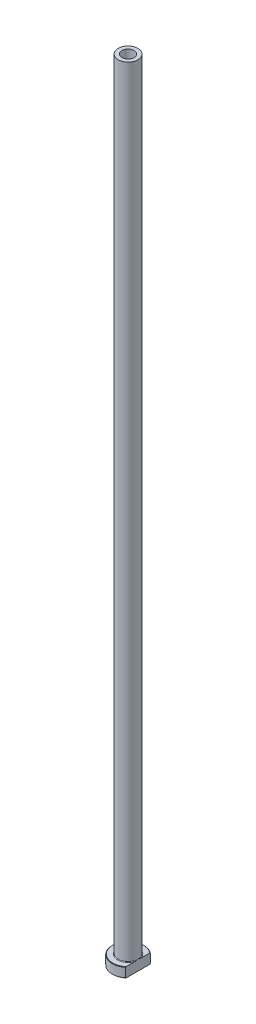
ISO-10303-21;
HEADER;
FILE_DESCRIPTION(('STEP AP214'),'2;1');
FILE_NAME('part.step','',(''),(''),'','','');
FILE_SCHEMA(('AUTOMOTIVE_DESIGN { 1 0 10303 214 1 1 1 1 }'));
ENDSEC;
DATA;
#1=APPLICATION_CONTEXT('core data for automotive mechanical design processes');
#2=APPLICATION_PROTOCOL_DEFINITION('international standard','automotive_design',2000,#1);
#3=PRODUCT_CONTEXT('',#1,'mechanical');
#4=PRODUCT('Part','Part','',(#3));
#5=PRODUCT_RELATED_PRODUCT_CATEGORY('part','',(#4));
#6=PRODUCT_DEFINITION_FORMATION('','',#4);
#7=PRODUCT_DEFINITION_CONTEXT('part definition',#1,'design');
#8=PRODUCT_DEFINITION('design','',#6,#7);
#9=PRODUCT_DEFINITION_SHAPE('','',#8);
#10=(LENGTH_UNIT() NAMED_UNIT(*) SI_UNIT(.MILLI.,.METRE.));
#11=(NAMED_UNIT(*) PLANE_ANGLE_UNIT() SI_UNIT($,.RADIAN.));
#12=(NAMED_UNIT(*) SI_UNIT($,.STERADIAN.) SOLID_ANGLE_UNIT());
#13=UNCERTAINTY_MEASURE_WITH_UNIT(LENGTH_MEASURE(1.E-05),#10,'distance_accuracy_value','');
#14=(GEOMETRIC_REPRESENTATION_CONTEXT(3) GLOBAL_UNCERTAINTY_ASSIGNED_CONTEXT((#13)) GLOBAL_UNIT_ASSIGNED_CONTEXT((#10,
#11,#12)) REPRESENTATION_CONTEXT('',''));
#15=CARTESIAN_POINT('',(0.,0.,0.));
#16=DIRECTION('',(0.,0.,1.));
#17=DIRECTION('',(1.,0.,0.));
#18=AXIS2_PLACEMENT_3D('',#15,#16,#17);
#19=CARTESIAN_POINT('',(0.,92.1876809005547,0.));
#20=DIRECTION('',(0.,1.,0.));
#21=DIRECTION('',(0.,0.,1.));
#22=AXIS2_PLACEMENT_3D('',#19,#20,#21);
#23=CYLINDRICAL_SURFACE('',#22,3.10000000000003);
#24=CARTESIAN_POINT('',(0.,400.,0.));
#25=DIRECTION('',(0.,1.,0.));
#26=DIRECTION('',(0.,0.,1.));
#27=AXIS2_PLACEMENT_3D('',#24,#25,#26);
#28=CIRCLE('',#27,3.10000000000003);
#29=CARTESIAN_POINT('',(0.,400.,3.10000000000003));
#30=VERTEX_POINT('',#29);
#31=EDGE_CURVE('E167',#30,#30,#28,.T.);
#32=ORIENTED_EDGE('',*,*,#31,.T.);
#33=EDGE_LOOP('',(#32));
#34=FACE_BOUND('',#33,.T.);
#35=CARTESIAN_POINT('',(0.,355.,0.));
#36=DIRECTION('',(0.,1.,0.));
#37=DIRECTION('',(0.,0.,1.));
#38=AXIS2_PLACEMENT_3D('',#35,#36,#37);
#39=CIRCLE('',#38,3.10000000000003);
#40=CARTESIAN_POINT('',(0.,355.,3.10000000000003));
#41=VERTEX_POINT('',#40);
#42=EDGE_CURVE('E170',#41,#41,#39,.T.);
#43=ORIENTED_EDGE('',*,*,#42,.F.);
#44=EDGE_LOOP('',(#43));
#45=FACE_BOUND('',#44,.T.);
#46=ADVANCED_FACE('F32',(#34,#45),#23,.F.);
#47=CARTESIAN_POINT('',(-3.10000000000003,400.,0.));
#48=DIRECTION('',(0.,1.,0.));
#49=DIRECTION('',(0.,0.,1.));
#50=AXIS2_PLACEMENT_3D('',#47,#48,#49);
#51=PLANE('',#50);
#52=CARTESIAN_POINT('',(0.,400.,0.));
#53=DIRECTION('',(0.,1.,0.));
#54=DIRECTION('',(0.,0.,1.));
#55=AXIS2_PLACEMENT_3D('',#52,#53,#54);
#56=CIRCLE('',#55,5.00000000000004);
#57=CARTESIAN_POINT('',(0.,400.,5.00000000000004));
#58=VERTEX_POINT('',#57);
#59=EDGE_CURVE('E174',#58,#58,#56,.T.);
#60=ORIENTED_EDGE('',*,*,#59,.T.);
#61=EDGE_LOOP('',(#60));
#62=FACE_BOUND('',#61,.T.);
#63=ORIENTED_EDGE('',*,*,#31,.F.);
#64=EDGE_LOOP('',(#63));
#65=FACE_BOUND('',#64,.T.);
#66=ADVANCED_FACE('F157',(#62,#65),#51,.T.);
#67=CARTESIAN_POINT('',(0.,92.1876809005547,0.));
#68=DIRECTION('',(0.,1.,0.));
#69=DIRECTION('',(0.,0.,1.));
#70=AXIS2_PLACEMENT_3D('',#67,#68,#69);
#71=CYLINDRICAL_SURFACE('',#70,5.00000000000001);
#72=CARTESIAN_POINT('',(0.,5.3,0.));
#73=DIRECTION('',(0.,1.,0.));
#74=DIRECTION('',(0.,0.,1.));
#75=AXIS2_PLACEMENT_3D('',#72,#73,#74);
#76=CIRCLE('',#75,5.00000000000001);
#77=CARTESIAN_POINT('',(5.,5.3,0.));
#78=VERTEX_POINT('',#77);
#79=EDGE_CURVE('E180',#78,#78,#76,.T.);
#80=ORIENTED_EDGE('',*,*,#79,.T.);
#81=EDGE_LOOP('',(#80));
#82=FACE_BOUND('',#81,.T.);
#83=ORIENTED_EDGE('',*,*,#59,.F.);
#84=EDGE_LOOP('',(#83));
#85=FACE_BOUND('',#84,.T.);
#86=ADVANCED_FACE('F162',(#82,#85),#71,.T.);
#87=CARTESIAN_POINT('',(-4.99999999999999,5.,0.));
#88=DIRECTION('',(0.,1.,0.));
#89=DIRECTION('',(0.,0.,1.));
#90=AXIS2_PLACEMENT_3D('',#87,#88,#89);
#91=PLANE('',#90);
#92=DIRECTION('',(0.,0.,1.));
#93=VECTOR('',#92,1.);
#94=CARTESIAN_POINT('',(5.,5.,0.));
#95=LINE('',#94,#93);
#96=CARTESIAN_POINT('',(5.,5.,-5.98665181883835));
#97=VERTEX_POINT('',#96);
#98=CARTESIAN_POINT('',(5.,5.,-1.75783958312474));
#99=VERTEX_POINT('',#98);
#100=EDGE_CURVE('E54',#97,#99,#95,.T.);
#101=ORIENTED_EDGE('',*,*,#100,.F.);
#102=CARTESIAN_POINT('',(0.,5.,0.));
#103=DIRECTION('',(0.,1.,0.));
#104=DIRECTION('',(0.,0.,1.));
#105=AXIS2_PLACEMENT_3D('',#102,#103,#104);
#106=CIRCLE('',#105,7.80000000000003);
#107=CARTESIAN_POINT('',(4.99999999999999,5.,5.98665181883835));
#108=VERTEX_POINT('',#107);
#109=EDGE_CURVE('E186',#97,#108,#106,.T.);
#110=ORIENTED_EDGE('',*,*,#109,.T.);
#111=CARTESIAN_POINT('',(5.,5.,1.75783958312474));
#112=VERTEX_POINT('',#111);
#113=EDGE_CURVE('E134',#112,#108,#95,.T.);
#114=ORIENTED_EDGE('',*,*,#113,.F.);
#115=CARTESIAN_POINT('',(0.,5.,0.));
#116=DIRECTION('',(0.,1.,0.));
#117=DIRECTION('',(0.,0.,1.));
#118=AXIS2_PLACEMENT_3D('',#115,#116,#117);
#119=CIRCLE('',#118,5.30000000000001);
#120=EDGE_CURVE('E183',#112,#99,#119,.F.);
#121=ORIENTED_EDGE('',*,*,#120,.T.);
#122=EDGE_LOOP('',(#101,#110,#114,#121));
#123=FACE_BOUND('',#122,.T.);
#124=ADVANCED_FACE('F197',(#123),#91,.T.);
#125=CARTESIAN_POINT('',(0.,92.1876809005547,0.));
#126=DIRECTION('',(0.,1.,0.));
#127=DIRECTION('',(0.,0.,1.));
#128=AXIS2_PLACEMENT_3D('',#125,#126,#127);
#129=CYLINDRICAL_SURFACE('',#128,7.99999999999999);
#130=DIRECTION('',(0.,-1.,0.));
#131=VECTOR('',#130,1.);
#132=CARTESIAN_POINT('',(4.99999999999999,400.,6.24499799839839));
#133=LINE('',#132,#131);
#134=CARTESIAN_POINT('',(4.99999999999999,4.80000000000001,6.24499799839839));
#135=VERTEX_POINT('',#134);
#136=CARTESIAN_POINT('',(4.99999999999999,0.200000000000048,6.24499799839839));
#137=VERTEX_POINT('',#136);
#138=EDGE_CURVE('E82',#135,#137,#133,.T.);
#139=ORIENTED_EDGE('',*,*,#138,.F.);
#140=CARTESIAN_POINT('',(0.,4.80000000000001,0.));
#141=DIRECTION('',(0.,1.,0.));
#142=DIRECTION('',(0.,0.,1.));
#143=AXIS2_PLACEMENT_3D('',#140,#141,#142);
#144=CIRCLE('',#143,7.99999999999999);
#145=CARTESIAN_POINT('',(5.,4.80000000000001,-6.24499799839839));
#146=VERTEX_POINT('',#145);
#147=EDGE_CURVE('E95',#135,#146,#144,.F.);
#148=ORIENTED_EDGE('',*,*,#147,.T.);
#149=DIRECTION('',(0.,-1.,0.));
#150=VECTOR('',#149,1.);
#151=CARTESIAN_POINT('',(5.,400.,-6.24499799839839));
#152=LINE('',#151,#150);
#153=CARTESIAN_POINT('',(5.,0.200000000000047,-6.24499799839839));
#154=VERTEX_POINT('',#153);
#155=EDGE_CURVE('E192',#146,#154,#152,.T.);
#156=ORIENTED_EDGE('',*,*,#155,.T.);
#157=CARTESIAN_POINT('',(0.,0.200000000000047,0.));
#158=DIRECTION('',(0.,-1.,0.));
#159=DIRECTION('',(0.,0.,-1.));
#160=AXIS2_PLACEMENT_3D('',#157,#158,#159);
#161=CIRCLE('',#160,7.99999999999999);
#162=EDGE_CURVE('E98',#154,#137,#161,.F.);
#163=ORIENTED_EDGE('',*,*,#162,.T.);
#164=EDGE_LOOP('',(#139,#148,#156,#163));
#165=FACE_BOUND('',#164,.T.);
#166=ADVANCED_FACE('F190',(#165),#129,.T.);
#167=CARTESIAN_POINT('',(-7.99999999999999,0.,0.));
#168=DIRECTION('',(0.,-1.,0.));
#169=DIRECTION('',(0.,0.,-1.));
#170=AXIS2_PLACEMENT_3D('',#167,#168,#169);
#171=PLANE('',#170);
#172=CARTESIAN_POINT('',(0.,0.,0.));
#173=DIRECTION('',(0.,-1.,0.));
#174=DIRECTION('',(0.,0.,-1.));
#175=AXIS2_PLACEMENT_3D('',#172,#173,#174);
#176=CIRCLE('',#175,3.84999999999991);
#177=CARTESIAN_POINT('',(0.,0.,-3.84999999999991));
#178=VERTEX_POINT('',#177);
#179=EDGE_CURVE('E40',#178,#178,#176,.F.);
#180=ORIENTED_EDGE('',*,*,#179,.T.);
#181=EDGE_LOOP('',(#180));
#182=FACE_BOUND('',#181,.T.);
#183=DIRECTION('',(0.,0.,-1.));
#184=VECTOR('',#183,1.);
#185=CARTESIAN_POINT('',(4.99999999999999,0.,6.24499799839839));
#186=LINE('',#185,#184);
#187=CARTESIAN_POINT('',(4.99999999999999,0.,5.9866518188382));
#188=VERTEX_POINT('',#187);
#189=CARTESIAN_POINT('',(5.,0.,-5.9866518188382));
#190=VERTEX_POINT('',#189);
#191=EDGE_CURVE('E47',#188,#190,#186,.T.);
#192=ORIENTED_EDGE('',*,*,#191,.F.);
#193=CARTESIAN_POINT('',(0.,0.,0.));
#194=DIRECTION('',(0.,-1.,0.));
#195=DIRECTION('',(0.,0.,-1.));
#196=AXIS2_PLACEMENT_3D('',#193,#194,#195);
#197=CIRCLE('',#196,7.79999999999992);
#198=EDGE_CURVE('E92',#188,#190,#197,.T.);
#199=ORIENTED_EDGE('',*,*,#198,.T.);
#200=EDGE_LOOP('',(#192,#199));
#201=FACE_BOUND('',#200,.T.);
#202=ADVANCED_FACE('F91',(#182,#201),#171,.T.);
#203=CARTESIAN_POINT('',(0.,92.1876809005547,0.));
#204=DIRECTION('',(0.,1.,0.));
#205=DIRECTION('',(0.,0.,1.));
#206=AXIS2_PLACEMENT_3D('',#203,#204,#205);
#207=CYLINDRICAL_SURFACE('',#206,3.35000000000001);
#208=CARTESIAN_POINT('',(0.,0.499999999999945,0.));
#209=DIRECTION('',(0.,-1.,0.));
#210=DIRECTION('',(0.,0.,-1.));
#211=AXIS2_PLACEMENT_3D('',#208,#209,#210);
#212=CIRCLE('',#211,3.35000000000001);
#213=CARTESIAN_POINT('',(0.,0.499999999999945,-3.35000000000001));
#214=VERTEX_POINT('',#213);
#215=EDGE_CURVE('E11',#214,#214,#212,.T.);
#216=ORIENTED_EDGE('',*,*,#215,.T.);
#217=EDGE_LOOP('',(#216));
#218=FACE_BOUND('',#217,.T.);
#219=CARTESIAN_POINT('',(0.,343.,0.));
#220=DIRECTION('',(0.,1.,0.));
#221=DIRECTION('',(0.,0.,1.));
#222=AXIS2_PLACEMENT_3D('',#219,#220,#221);
#223=CIRCLE('',#222,3.35000000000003);
#224=CARTESIAN_POINT('',(0.,343.,3.35000000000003));
#225=VERTEX_POINT('',#224);
#226=EDGE_CURVE('E172',#225,#225,#223,.T.);
#227=ORIENTED_EDGE('',*,*,#226,.T.);
#228=EDGE_LOOP('',(#227));
#229=FACE_BOUND('',#228,.T.);
#230=ADVANCED_FACE('F215',(#218,#229),#207,.F.);
#231=CARTESIAN_POINT('',(0.,343.,0.));
#232=DIRECTION('',(0.,-1.,0.));
#233=DIRECTION('',(0.,0.,-1.));
#234=AXIS2_PLACEMENT_3D('',#231,#232,#233);
#235=CONICAL_SURFACE('',#234,3.35000000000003,0.0208303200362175);
#236=ORIENTED_EDGE('',*,*,#42,.T.);
#237=EDGE_LOOP('',(#236));
#238=FACE_BOUND('',#237,.T.);
#239=ORIENTED_EDGE('',*,*,#226,.F.);
#240=EDGE_LOOP('',(#239));
#241=FACE_BOUND('',#240,.T.);
#242=ADVANCED_FACE('F111',(#238,#241),#235,.F.);
#243=CARTESIAN_POINT('',(0.,5.3,0.));
#244=DIRECTION('',(0.,1.,0.));
#245=DIRECTION('',(0.,0.,1.));
#246=AXIS2_PLACEMENT_3D('',#243,#244,#245);
#247=TOROIDAL_SURFACE('',#246,5.30000000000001,0.3);
#248=ORIENTED_EDGE('',*,*,#120,.F.);
#249=CARTESIAN_POINT('',(5.,5.3,0.));
#250=CARTESIAN_POINT('',(5.,5.30000062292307,-1.31469219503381E-10));
#251=CARTESIAN_POINT('',(5.,5.30000124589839,2.52759529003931E-07));
#252=CARTESIAN_POINT('',(5.,5.30000240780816,9.47164985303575E-07));
#253=CARTESIAN_POINT('',(5.,5.30000293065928,1.40594109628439E-06));
#254=CARTESIAN_POINT('',(5.,5.30000402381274,2.50637707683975E-06));
#255=CARTESIAN_POINT('',(5.,5.30000457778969,3.16589032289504E-06));
#256=CARTESIAN_POINT('',(5.,5.30000556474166,4.5286010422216E-06));
#257=CARTESIAN_POINT('',(5.,5.3000060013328,5.22939577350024E-06));
#258=CARTESIAN_POINT('',(5.,5.30000763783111,7.96122203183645E-06));
#259=CARTESIAN_POINT('',(5.,5.30000875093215,1.00477437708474E-05));
#260=CARTESIAN_POINT('',(5.,5.30001056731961,1.41660905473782E-05));
#261=CARTESIAN_POINT('',(5.,5.30001129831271,1.61861811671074E-05));
#262=CARTESIAN_POINT('',(5.,5.30001439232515,2.47865788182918E-05));
#263=CARTESIAN_POINT('',(5.,5.30001672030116,3.1383034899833E-05));
#264=CARTESIAN_POINT('',(5.,5.30002012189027,4.38084295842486E-05));
#265=CARTESIAN_POINT('',(5.,5.30002133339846,4.95992806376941E-05));
#266=CARTESIAN_POINT('',(5.,5.30003020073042,9.2786271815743E-05));
#267=CARTESIAN_POINT('',(5.,5.30003696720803,0.000130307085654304));
#268=CARTESIAN_POINT('',(4.99999999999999,5.30006659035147,0.000278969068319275));
#269=CARTESIAN_POINT('',(5.,5.30009481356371,0.000389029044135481));
#270=CARTESIAN_POINT('',(5.,5.30020506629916,0.000826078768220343));
#271=CARTESIAN_POINT('',(5.,5.30028365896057,0.00115365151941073));
#272=CARTESIAN_POINT('',(4.99999999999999,5.30059919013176,0.00245925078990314));
#273=CARTESIAN_POINT('',(4.99999999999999,5.30084048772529,0.00343651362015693));
#274=CARTESIAN_POINT('',(5.,5.30184626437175,0.00752058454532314));
#275=CARTESIAN_POINT('',(5.,5.30260525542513,0.0106283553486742));
#276=CARTESIAN_POINT('',(4.99999999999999,5.30996461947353,0.0407482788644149));
#277=CARTESIAN_POINT('',(4.99999999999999,5.31658985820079,0.0677561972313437));
#278=CARTESIAN_POINT('',(5.,5.32953319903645,0.120688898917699));
#279=CARTESIAN_POINT('',(5.,5.33585289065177,0.146613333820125));
#280=CARTESIAN_POINT('',(4.99999999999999,5.34926050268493,0.201795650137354));
#281=CARTESIAN_POINT('',(5.,5.35634306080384,0.231054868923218));
#282=CARTESIAN_POINT('',(5.,5.37050252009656,0.289917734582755));
#283=CARTESIAN_POINT('',(5.,5.37757848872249,0.319521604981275));
#284=CARTESIAN_POINT('',(5.,5.39452602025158,0.391032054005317));
#285=CARTESIAN_POINT('',(5.,5.40434071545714,0.432952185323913));
#286=CARTESIAN_POINT('',(5.,5.42340141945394,0.515763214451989));
#287=CARTESIAN_POINT('',(5.,5.43265559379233,0.556652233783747));
#288=CARTESIAN_POINT('',(5.,5.45710553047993,0.667075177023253));
#289=CARTESIAN_POINT('',(5.,5.47194176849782,0.736689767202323));
#290=CARTESIAN_POINT('',(5.,5.50018229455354,0.876836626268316));
#291=CARTESIAN_POINT('',(5.,5.51357312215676,0.947371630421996));
#292=CARTESIAN_POINT('',(5.,5.53930921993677,1.09497328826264));
#293=CARTESIAN_POINT('',(5.,5.55146217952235,1.17207432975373));
#294=CARTESIAN_POINT('',(5.,5.57239669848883,1.32672649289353));
#295=CARTESIAN_POINT('',(5.,5.58117877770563,1.40427754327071));
#296=CARTESIAN_POINT('',(5.,5.59499725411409,1.56873827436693));
#297=CARTESIAN_POINT('',(5.,5.5994880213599,1.65570044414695));
#298=CARTESIAN_POINT('',(5.,5.60018885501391,1.78535304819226));
#299=CARTESIAN_POINT('',(5.,5.59945214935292,1.82802575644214));
#300=CARTESIAN_POINT('',(5.,5.59559364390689,1.91325081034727));
#301=CARTESIAN_POINT('',(5.,5.5924731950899,1.95580321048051));
#302=CARTESIAN_POINT('',(5.,5.58383242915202,2.03512365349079));
#303=CARTESIAN_POINT('',(5.,5.57867386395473,2.07192937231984));
#304=CARTESIAN_POINT('',(5.,5.5654379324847,2.14526756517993));
#305=CARTESIAN_POINT('',(5.,5.55734203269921,2.18179676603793));
#306=CARTESIAN_POINT('',(5.,5.53718005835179,2.25427226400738));
#307=CARTESIAN_POINT('',(5.,5.52507057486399,2.29020746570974));
#308=CARTESIAN_POINT('',(5.,5.50270928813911,2.34223029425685));
#309=CARTESIAN_POINT('',(5.,5.49457811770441,2.35922314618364));
#310=CARTESIAN_POINT('',(5.,5.476578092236,2.39224900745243));
#311=CARTESIAN_POINT('',(5.,5.46671281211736,2.40828390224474));
#312=CARTESIAN_POINT('',(5.,5.44695893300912,2.43579467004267));
#313=CARTESIAN_POINT('',(5.,5.43745879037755,2.44754592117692));
#314=CARTESIAN_POINT('',(5.,5.41677914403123,2.46946476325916));
#315=CARTESIAN_POINT('',(5.,5.40560543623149,2.47963758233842));
#316=CARTESIAN_POINT('',(5.,5.38617750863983,2.49393642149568));
#317=CARTESIAN_POINT('',(5.,5.37851643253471,2.49886271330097));
#318=CARTESIAN_POINT('',(5.,5.3625274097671,2.5074995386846));
#319=CARTESIAN_POINT('',(5.,5.35419984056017,2.51121075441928));
#320=CARTESIAN_POINT('',(5.,5.33690648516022,2.51712941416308));
#321=CARTESIAN_POINT('',(5.,5.32793451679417,2.519319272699));
#322=CARTESIAN_POINT('',(5.,5.30973576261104,2.52185978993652));
#323=CARTESIAN_POINT('',(5.,5.30050931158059,2.52221275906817));
#324=CARTESIAN_POINT('',(5.,5.28349166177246,2.52112455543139));
#325=CARTESIAN_POINT('',(5.,5.27568322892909,2.51993178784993));
#326=CARTESIAN_POINT('',(5.,5.26036860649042,2.51628294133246));
#327=CARTESIAN_POINT('',(5.,5.25286261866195,2.51382603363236));
#328=CARTESIAN_POINT('',(5.,5.23590266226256,2.50685484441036));
#329=CARTESIAN_POINT('',(5.,5.2266187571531,2.50192984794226));
#330=CARTESIAN_POINT('',(5.,5.20895514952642,2.49066548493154));
#331=CARTESIAN_POINT('',(5.,5.20057756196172,2.4843229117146));
#332=CARTESIAN_POINT('',(5.,5.17987008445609,2.46645212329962));
#333=CARTESIAN_POINT('',(5.,5.16824151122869,2.45411867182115));
#334=CARTESIAN_POINT('',(5.,5.14692461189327,2.42790849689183));
#335=CARTESIAN_POINT('',(5.,5.13723987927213,2.41402898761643));
#336=CARTESIAN_POINT('',(5.,5.11080706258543,2.37143175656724));
#337=CARTESIAN_POINT('',(5.,5.09628770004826,2.34134703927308));
#338=CARTESIAN_POINT('',(5.,5.07130349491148,2.27940731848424));
#339=CARTESIAN_POINT('',(5.,5.06087110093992,2.24754035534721));
#340=CARTESIAN_POINT('',(5.,5.03890359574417,2.16787245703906));
#341=CARTESIAN_POINT('',(5.,5.02913523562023,2.11959065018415));
#342=CARTESIAN_POINT('',(5.,5.01416953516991,2.02224928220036));
#343=CARTESIAN_POINT('',(5.,5.00898637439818,1.97318778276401));
#344=CARTESIAN_POINT('',(5.,5.00220823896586,1.87635767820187));
#345=CARTESIAN_POINT('',(5.,5.00050709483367,1.82859609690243));
#346=CARTESIAN_POINT('',(5.,4.99969104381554,1.7333016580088));
#347=CARTESIAN_POINT('',(5.,5.00056327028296,1.68576884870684));
#348=CARTESIAN_POINT('',(5.,5.00484296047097,1.57937770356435));
#349=CARTESIAN_POINT('',(5.,5.00880932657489,1.52054285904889));
#350=CARTESIAN_POINT('',(5.,5.01925964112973,1.40312974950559));
#351=CARTESIAN_POINT('',(5.,5.02574264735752,1.3445513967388));
#352=CARTESIAN_POINT('',(5.,5.04090087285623,1.22627662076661));
#353=CARTESIAN_POINT('',(5.,5.04962425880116,1.16658647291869));
#354=CARTESIAN_POINT('',(5.,5.06877923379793,1.04732463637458));
#355=CARTESIAN_POINT('',(5.,5.07921523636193,0.987753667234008));
#356=CARTESIAN_POINT('',(5.,5.10551698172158,0.846936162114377));
#357=CARTESIAN_POINT('',(5.,5.12196565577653,0.765799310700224));
#358=CARTESIAN_POINT('',(5.,5.15639716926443,0.604819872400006));
#359=CARTESIAN_POINT('',(5.,5.17436050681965,0.524973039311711));
#360=CARTESIAN_POINT('',(4.99999999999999,5.20921667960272,0.374726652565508));
#361=CARTESIAN_POINT('',(4.99999999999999,5.22599388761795,0.304300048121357));
#362=CARTESIAN_POINT('',(5.,5.25191105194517,0.196907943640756));
#363=CARTESIAN_POINT('',(5.,5.26090146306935,0.159905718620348));
#364=CARTESIAN_POINT('',(4.99999999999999,5.27881854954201,0.0865164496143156));
#365=CARTESIAN_POINT('',(4.99999999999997,5.28774391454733,0.0501291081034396));
#366=CARTESIAN_POINT('',(5.,5.29739627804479,0.0106218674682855));
#367=CARTESIAN_POINT('',(5.,5.2981568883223,0.00750762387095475));
#368=CARTESIAN_POINT('',(4.99999999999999,5.29916304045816,0.00342209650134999));
#369=CARTESIAN_POINT('',(4.99999999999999,5.29940309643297,0.00244985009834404));
#370=CARTESIAN_POINT('',(5.,5.29971711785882,0.00115049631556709));
#371=CARTESIAN_POINT('',(5.,5.29979541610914,0.000824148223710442));
#372=CARTESIAN_POINT('',(4.99999999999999,5.29990531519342,0.000388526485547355));
#373=CARTESIAN_POINT('',(4.99999999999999,5.29993348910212,0.0002786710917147));
#374=CARTESIAN_POINT('',(5.,5.2999630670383,0.000130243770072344));
#375=CARTESIAN_POINT('',(5.,5.29996982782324,9.2751148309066E-05));
#376=CARTESIAN_POINT('',(5.,5.29997868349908,4.95929956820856E-05));
#377=CARTESIAN_POINT('',(5.,5.29997989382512,4.38036630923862E-05));
#378=CARTESIAN_POINT('',(5.,5.29998329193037,3.1381425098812E-05));
#379=CARTESIAN_POINT('',(5.00000000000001,5.29998561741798,2.47865267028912E-05));
#380=CARTESIAN_POINT('',(5.,5.29998870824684,1.61877575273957E-05));
#381=CARTESIAN_POINT('',(5.,5.29998943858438,1.4167780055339E-05));
#382=CARTESIAN_POINT('',(5.,5.29999125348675,1.00495559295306E-05));
#383=CARTESIAN_POINT('',(5.,5.29999236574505,7.96302878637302E-06));
#384=CARTESIAN_POINT('',(5.,5.29999400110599,5.23107548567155E-06));
#385=CARTESIAN_POINT('',(5.,5.29999443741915,4.53021173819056E-06));
#386=CARTESIAN_POINT('',(5.,5.29999542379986,3.1673128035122E-06));
#387=CARTESIAN_POINT('',(5.,5.29999597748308,2.50767829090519E-06));
#388=CARTESIAN_POINT('',(5.,5.29999707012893,1.40695951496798E-06));
#389=CARTESIAN_POINT('',(5.,5.29999759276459,9.48033092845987E-07));
#390=CARTESIAN_POINT('',(5.,5.29999875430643,2.53244638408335E-07));
#391=CARTESIAN_POINT('',(5.,5.29999937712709,1.31460021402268E-10));
#392=CARTESIAN_POINT('',(5.,5.3,0.));
#393=B_SPLINE_CURVE_WITH_KNOTS('',3,(#249,#250,#251,#252,#253,#254,#255,#256,#257,#258,#259,
#260,#261,#262,#263,#264,#265,#266,#267,#268,#269,#270,#271,#272,#273,#274,#275,#276,#277,#278,
#279,#280,#281,#282,#283,#284,#285,#286,#287,#288,#289,#290,#291,#292,#293,#294,#295,#296,#297,
#298,#299,#300,#301,#302,#303,#304,#305,#306,#307,#308,#309,#310,#311,#312,#313,#314,#315,#316,
#317,#318,#319,#320,#321,#322,#323,#324,#325,#326,#327,#328,#329,#330,#331,#332,#333,#334,#335,
#336,#337,#338,#339,#340,#341,#342,#343,#344,#345,#346,#347,#348,#349,#350,#351,#352,#353,#354,
#355,#356,#357,#358,#359,#360,#361,#362,#363,#364,#365,#366,#367,#368,#369,#370,#371,#372,#373,
#374,#375,#376,#377,#378,#379,#380,#381,#382,#383,#384,#385,#386,#387,#388,#389,#390,#391,#392),
.UNSPECIFIED.,.T.,.F.,(4,2,2,2,2,2,2,2,2,2,2,2,2,2,2,2,2,2,2,2,2,2,2,2,2,2,2,2,2,2,2,2,2,2,2,2,
2,2,2,2,2,2,2,2,2,2,2,2,2,2,2,2,2,2,2,2,2,2,2,2,2,2,2,2,2,2,2,2,2,2,2,4),(0.,
1.88938937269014E-06,3.9805824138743E-06,6.54817710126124E-06,9.02403309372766E-06,
1.60938629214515E-05,2.25328043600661E-05,4.34843776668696E-05,6.12120009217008E-05,
0.000175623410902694,0.000516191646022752,0.00152710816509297,0.00454656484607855,
0.0141443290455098,0.0975679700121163,0.17761933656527,0.267931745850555,0.359245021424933,
0.48840519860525,0.614173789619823,0.82769427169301,1.04305715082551,1.27715608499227,
1.5112189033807,1.77214751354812,1.90013509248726,2.02805018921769,2.13945459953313,
2.25157451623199,2.36494894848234,2.42139235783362,2.47772074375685,2.52293802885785,
2.56800219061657,2.59524342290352,2.62246933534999,2.65000494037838,2.67750590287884,
2.70108948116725,2.72468854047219,2.75603978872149,2.7874626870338,2.83802806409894,
2.88868607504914,2.98834295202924,3.08877575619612,3.2361865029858,3.38405153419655,
3.52733651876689,3.6699063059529,3.84673903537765,4.0235056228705,4.20444776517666,
4.38586374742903,4.63419556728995,4.87971270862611,5.09690175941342,5.21113882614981,
5.32353360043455,5.3331513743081,5.33615533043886,5.33716246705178,5.33750240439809,
5.33761672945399,5.33763445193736,5.33765539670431,5.33766183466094,5.33766890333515,
5.33767137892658,5.33767394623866,5.33767603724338,5.3376779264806),.UNSPECIFIED.);
#394=EDGE_CURVE('E126',#112,#78,#393,.T.);
#395=ORIENTED_EDGE('',*,*,#394,.T.);
#396=ORIENTED_EDGE('',*,*,#79,.F.);
#397=CARTESIAN_POINT('',(5.,5.3,0.));
#398=CARTESIAN_POINT('',(5.,5.29999937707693,1.31470732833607E-10));
#399=CARTESIAN_POINT('',(5.,5.2999987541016,-2.52759527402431E-07));
#400=CARTESIAN_POINT('',(5.,5.29999759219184,-9.47164983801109E-07));
#401=CARTESIAN_POINT('',(5.,5.29999706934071,-1.40594109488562E-06));
#402=CARTESIAN_POINT('',(5.,5.29999597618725,-2.50637707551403E-06));
#403=CARTESIAN_POINT('',(5.,5.29999542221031,-3.16589032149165E-06));
#404=CARTESIAN_POINT('',(5.,5.29999443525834,-4.52860104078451E-06));
#405=CARTESIAN_POINT('',(5.,5.2999939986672,-5.22939577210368E-06));
#406=CARTESIAN_POINT('',(5.,5.29999236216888,-7.96122203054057E-06));
#407=CARTESIAN_POINT('',(5.,5.29999124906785,-1.00477437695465E-05));
#408=CARTESIAN_POINT('',(5.,5.29998943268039,-1.41660905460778E-05));
#409=CARTESIAN_POINT('',(5.,5.29998870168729,-1.61861811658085E-05));
#410=CARTESIAN_POINT('',(5.,5.29998560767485,-2.47865788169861E-05));
#411=CARTESIAN_POINT('',(5.,5.29998327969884,-3.13830348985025E-05));
#412=CARTESIAN_POINT('',(5.,5.29997987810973,-4.38084295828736E-05));
#413=CARTESIAN_POINT('',(5.,5.29997866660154,-4.95992806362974E-05));
#414=CARTESIAN_POINT('',(5.,5.29996979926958,-9.27862718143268E-05));
#415=CARTESIAN_POINT('',(5.,5.29996303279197,-0.000130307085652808));
#416=CARTESIAN_POINT('',(4.99999999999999,5.29993340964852,-0.000278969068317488));
#417=CARTESIAN_POINT('',(5.,5.29990518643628,-0.000389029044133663));
#418=CARTESIAN_POINT('',(5.,5.29979493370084,-0.000826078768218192));
#419=CARTESIAN_POINT('',(5.,5.29971634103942,-0.00115365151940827));
#420=CARTESIAN_POINT('',(4.99999999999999,5.29940080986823,-0.00245925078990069));
#421=CARTESIAN_POINT('',(4.99999999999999,5.29915951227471,-0.00343651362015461));
#422=CARTESIAN_POINT('',(5.,5.29815373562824,-0.00752058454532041));
#423=CARTESIAN_POINT('',(5.,5.29739474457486,-0.0106283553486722));
#424=CARTESIAN_POINT('',(4.99999999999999,5.29003538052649,-0.0407482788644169));
#425=CARTESIAN_POINT('',(4.99999999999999,5.28341014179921,-0.0677561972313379));
#426=CARTESIAN_POINT('',(5.,5.27046680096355,-0.120688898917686));
#427=CARTESIAN_POINT('',(5.,5.26414710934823,-0.146613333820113));
#428=CARTESIAN_POINT('',(4.99999999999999,5.25073949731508,-0.201795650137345));
#429=CARTESIAN_POINT('',(5.,5.24365693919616,-0.231054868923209));
#430=CARTESIAN_POINT('',(5.,5.22949747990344,-0.289917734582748));
#431=CARTESIAN_POINT('',(5.,5.22242151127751,-0.319521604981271));
#432=CARTESIAN_POINT('',(5.,5.20547397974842,-0.391032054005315));
#433=CARTESIAN_POINT('',(5.,5.19565928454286,-0.432952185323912));
#434=CARTESIAN_POINT('',(5.,5.17659858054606,-0.515763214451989));
#435=CARTESIAN_POINT('',(5.,5.16734440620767,-0.556652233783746));
#436=CARTESIAN_POINT('',(5.,5.14289446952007,-0.667075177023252));
#437=CARTESIAN_POINT('',(5.,5.12805823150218,-0.736689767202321));
#438=CARTESIAN_POINT('',(5.,5.09981770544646,-0.876836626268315));
#439=CARTESIAN_POINT('',(5.,5.08642687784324,-0.947371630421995));
#440=CARTESIAN_POINT('',(5.,5.06069078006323,-1.09497328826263));
#441=CARTESIAN_POINT('',(5.,5.04853782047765,-1.17207432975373));
#442=CARTESIAN_POINT('',(5.,5.02760330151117,-1.32672649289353));
#443=CARTESIAN_POINT('',(5.,5.01882122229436,-1.40427754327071));
#444=CARTESIAN_POINT('',(5.,5.00500274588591,-1.56873827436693));
#445=CARTESIAN_POINT('',(5.,5.00051197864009,-1.65570044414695));
#446=CARTESIAN_POINT('',(5.,4.99981114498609,-1.78535304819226));
#447=CARTESIAN_POINT('',(5.,5.00054785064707,-1.82802575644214));
#448=CARTESIAN_POINT('',(5.,5.0044063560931,-1.91325081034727));
#449=CARTESIAN_POINT('',(5.,5.0075268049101,-1.95580321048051));
#450=CARTESIAN_POINT('',(5.,5.01616757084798,-2.03512365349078));
#451=CARTESIAN_POINT('',(5.,5.02132613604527,-2.07192937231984));
#452=CARTESIAN_POINT('',(5.,5.0345620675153,-2.14526756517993));
#453=CARTESIAN_POINT('',(5.,5.04265796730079,-2.18179676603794));
#454=CARTESIAN_POINT('',(5.,5.06281994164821,-2.25427226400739));
#455=CARTESIAN_POINT('',(5.,5.07492942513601,-2.29020746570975));
#456=CARTESIAN_POINT('',(5.,5.09729071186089,-2.34223029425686));
#457=CARTESIAN_POINT('',(5.,5.1054218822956,-2.35922314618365));
#458=CARTESIAN_POINT('',(5.,5.123421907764,-2.39224900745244));
#459=CARTESIAN_POINT('',(5.,5.13328718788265,-2.40828390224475));
#460=CARTESIAN_POINT('',(5.,5.15304106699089,-2.43579467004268));
#461=CARTESIAN_POINT('',(5.,5.16254120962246,-2.44754592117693));
#462=CARTESIAN_POINT('',(5.,5.18322085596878,-2.46946476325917));
#463=CARTESIAN_POINT('',(5.,5.19439456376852,-2.47963758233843));
#464=CARTESIAN_POINT('',(5.,5.21382249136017,-2.49393642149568));
#465=CARTESIAN_POINT('',(5.,5.22148356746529,-2.49886271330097));
#466=CARTESIAN_POINT('',(5.,5.2374725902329,-2.5074995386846));
#467=CARTESIAN_POINT('',(5.,5.24580015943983,-2.51121075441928));
#468=CARTESIAN_POINT('',(5.,5.26309351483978,-2.51712941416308));
#469=CARTESIAN_POINT('',(5.,5.27206548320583,-2.519319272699));
#470=CARTESIAN_POINT('',(5.,5.29026423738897,-2.52185978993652));
#471=CARTESIAN_POINT('',(5.,5.29949068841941,-2.52221275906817));
#472=CARTESIAN_POINT('',(5.,5.31650833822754,-2.52112455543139));
#473=CARTESIAN_POINT('',(5.,5.32431677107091,-2.51993178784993));
#474=CARTESIAN_POINT('',(5.,5.33963139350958,-2.51628294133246));
#475=CARTESIAN_POINT('',(5.,5.34713738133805,-2.51382603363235));
#476=CARTESIAN_POINT('',(5.,5.36409733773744,-2.50685484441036));
#477=CARTESIAN_POINT('',(5.,5.3733812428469,-2.50192984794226));
#478=CARTESIAN_POINT('',(5.,5.39104485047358,-2.49066548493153));
#479=CARTESIAN_POINT('',(5.,5.39942243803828,-2.4843229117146));
#480=CARTESIAN_POINT('',(5.,5.42012991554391,-2.46645212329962));
#481=CARTESIAN_POINT('',(5.,5.43175848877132,-2.45411867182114));
#482=CARTESIAN_POINT('',(5.,5.45307538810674,-2.42790849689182));
#483=CARTESIAN_POINT('',(5.,5.46276012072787,-2.41402898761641));
#484=CARTESIAN_POINT('',(5.,5.48919293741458,-2.37143175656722));
#485=CARTESIAN_POINT('',(5.,5.50371229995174,-2.34134703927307));
#486=CARTESIAN_POINT('',(5.,5.52869650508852,-2.27940731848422));
#487=CARTESIAN_POINT('',(5.,5.53912889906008,-2.24754035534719));
#488=CARTESIAN_POINT('',(5.,5.56109640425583,-2.16787245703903));
#489=CARTESIAN_POINT('',(5.,5.57086476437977,-2.11959065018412));
#490=CARTESIAN_POINT('',(5.,5.58583046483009,-2.02224928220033));
#491=CARTESIAN_POINT('',(5.,5.59101362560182,-1.97318778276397));
#492=CARTESIAN_POINT('',(5.,5.59779176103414,-1.87635767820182));
#493=CARTESIAN_POINT('',(5.,5.59949290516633,-1.82859609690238));
#494=CARTESIAN_POINT('',(5.,5.60030895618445,-1.73330165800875));
#495=CARTESIAN_POINT('',(5.,5.59943672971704,-1.68576884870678));
#496=CARTESIAN_POINT('',(5.,5.59515703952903,-1.5793777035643));
#497=CARTESIAN_POINT('',(5.,5.59119067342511,-1.52054285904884));
#498=CARTESIAN_POINT('',(5.,5.58074035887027,-1.40312974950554));
#499=CARTESIAN_POINT('',(5.,5.57425735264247,-1.34455139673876));
#500=CARTESIAN_POINT('',(5.,5.55909912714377,-1.22627662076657));
#501=CARTESIAN_POINT('',(5.,5.55037574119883,-1.16658647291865));
#502=CARTESIAN_POINT('',(5.,5.53122076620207,-1.04732463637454));
#503=CARTESIAN_POINT('',(5.,5.52078476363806,-0.987753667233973));
#504=CARTESIAN_POINT('',(5.,5.49448301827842,-0.846936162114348));
#505=CARTESIAN_POINT('',(5.,5.47803434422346,-0.765799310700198));
#506=CARTESIAN_POINT('',(5.,5.44360283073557,-0.604819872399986));
#507=CARTESIAN_POINT('',(5.,5.42563949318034,-0.524973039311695));
#508=CARTESIAN_POINT('',(4.99999999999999,5.39078332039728,-0.374726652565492));
#509=CARTESIAN_POINT('',(4.99999999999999,5.37400611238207,-0.304300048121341));
#510=CARTESIAN_POINT('',(5.,5.34808894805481,-0.196907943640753));
#511=CARTESIAN_POINT('',(5.,5.3390985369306,-0.159905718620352));
#512=CARTESIAN_POINT('',(4.99999999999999,5.32118145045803,-0.0865164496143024));
#513=CARTESIAN_POINT('',(4.99999999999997,5.31225608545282,-0.0501291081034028));
#514=CARTESIAN_POINT('',(5.,5.30260372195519,-0.0106218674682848));
#515=CARTESIAN_POINT('',(5.,5.30184311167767,-0.00750762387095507));
#516=CARTESIAN_POINT('',(4.99999999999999,5.30083695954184,-0.00342209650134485));
#517=CARTESIAN_POINT('',(4.99999999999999,5.30059690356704,-0.00244985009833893));
#518=CARTESIAN_POINT('',(5.,5.30028288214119,-0.00115049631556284));
#519=CARTESIAN_POINT('',(5.,5.30020458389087,-0.000824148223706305));
#520=CARTESIAN_POINT('',(4.99999999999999,5.30009468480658,-0.000388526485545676));
#521=CARTESIAN_POINT('',(4.99999999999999,5.30006651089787,-0.00027867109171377));
#522=CARTESIAN_POINT('',(5.,5.30003693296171,-0.000130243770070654));
#523=CARTESIAN_POINT('',(5.,5.30003017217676,-9.27511483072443E-05));
#524=CARTESIAN_POINT('',(5.,5.30002131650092,-4.95929956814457E-05));
#525=CARTESIAN_POINT('',(5.,5.30002010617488,-4.38036630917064E-05));
#526=CARTESIAN_POINT('',(5.,5.30001670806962,-3.13814250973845E-05));
#527=CARTESIAN_POINT('',(5.00000000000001,5.30001438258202,-2.47865267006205E-05));
#528=CARTESIAN_POINT('',(5.,5.30001129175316,-1.61877575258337E-05));
#529=CARTESIAN_POINT('',(5.,5.30001056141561,-1.41677800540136E-05));
#530=CARTESIAN_POINT('',(5.,5.30000874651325,-1.00495559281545E-05));
#531=CARTESIAN_POINT('',(5.,5.30000763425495,-7.96302878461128E-06));
#532=CARTESIAN_POINT('',(5.,5.30000599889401,-5.2310754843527E-06));
#533=CARTESIAN_POINT('',(5.,5.30000556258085,-4.53021173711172E-06));
#534=CARTESIAN_POINT('',(5.,5.30000457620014,-3.16731280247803E-06));
#535=CARTESIAN_POINT('',(5.,5.30000402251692,-2.50767828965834E-06));
#536=CARTESIAN_POINT('',(5.,5.30000292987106,-1.40695951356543E-06));
#537=CARTESIAN_POINT('',(5.,5.30000240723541,-9.48033091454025E-07));
#538=CARTESIAN_POINT('',(5.,5.30000124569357,-2.53244637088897E-07));
#539=CARTESIAN_POINT('',(5.,5.30000062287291,-1.31458756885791E-10));
#540=CARTESIAN_POINT('',(5.,5.3,0.));
#541=B_SPLINE_CURVE_WITH_KNOTS('',3,(#397,#398,#399,#400,#401,#402,#403,#404,#405,#406,#407,
#408,#409,#410,#411,#412,#413,#414,#415,#416,#417,#418,#419,#420,#421,#422,#423,#424,#425,#426,
#427,#428,#429,#430,#431,#432,#433,#434,#435,#436,#437,#438,#439,#440,#441,#442,#443,#444,#445,
#446,#447,#448,#449,#450,#451,#452,#453,#454,#455,#456,#457,#458,#459,#460,#461,#462,#463,#464,
#465,#466,#467,#468,#469,#470,#471,#472,#473,#474,#475,#476,#477,#478,#479,#480,#481,#482,#483,
#484,#485,#486,#487,#488,#489,#490,#491,#492,#493,#494,#495,#496,#497,#498,#499,#500,#501,#502,
#503,#504,#505,#506,#507,#508,#509,#510,#511,#512,#513,#514,#515,#516,#517,#518,#519,#520,#521,
#522,#523,#524,#525,#526,#527,#528,#529,#530,#531,#532,#533,#534,#535,#536,#537,#538,#539,#540),
.UNSPECIFIED.,.T.,.F.,(4,2,2,2,2,2,2,2,2,2,2,2,2,2,2,2,2,2,2,2,2,2,2,2,2,2,2,2,2,2,2,2,2,2,2,2,
2,2,2,2,2,2,2,2,2,2,2,2,2,2,2,2,2,2,2,2,2,2,2,2,2,2,2,2,2,2,2,2,2,2,2,4),(0.,
1.88938937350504E-06,3.98058241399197E-06,6.54817710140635E-06,9.02403309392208E-06,
1.60938629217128E-05,2.25328043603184E-05,4.34843776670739E-05,6.12120009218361E-05,
0.000175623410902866,0.000516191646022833,0.00152710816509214,0.00454656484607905,
0.0141443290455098,0.0975679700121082,0.177619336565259,0.267931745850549,0.359245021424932,
0.488405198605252,0.614173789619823,0.82769427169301,1.04305715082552,1.27715608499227,
1.5112189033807,1.77214751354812,1.90013509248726,2.02805018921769,2.13945459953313,
2.251574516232,2.36494894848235,2.42139235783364,2.47772074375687,2.52293802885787,
2.56800219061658,2.59524342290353,2.62246933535,2.65000494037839,2.67750590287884,
2.70108948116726,2.7246885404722,2.75603978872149,2.78746268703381,2.83802806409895,
2.88868607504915,2.98834295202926,3.08877575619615,3.23618650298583,3.38405153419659,
3.52733651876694,3.66990630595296,3.8467390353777,4.02350562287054,4.20444776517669,
4.38586374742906,4.63419556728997,4.87971270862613,5.09690175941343,5.21113882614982,
5.32353360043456,5.33315137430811,5.33615533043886,5.33716246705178,5.33750240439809,
5.33761672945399,5.33763445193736,5.33765539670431,5.33766183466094,5.33766890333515,
5.33767137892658,5.33767394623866,5.33767603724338,5.3376779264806),.UNSPECIFIED.);
#542=EDGE_CURVE('E135',#78,#99,#541,.T.);
#543=ORIENTED_EDGE('',*,*,#542,.T.);
#544=EDGE_LOOP('',(#248,#395,#396,#543));
#545=FACE_BOUND('',#544,.T.);
#546=ADVANCED_FACE('F141',(#545),#247,.F.);
#547=CARTESIAN_POINT('',(0.,5.,0.));
#548=DIRECTION('',(0.,-1.,0.));
#549=DIRECTION('',(0.,0.,-1.));
#550=AXIS2_PLACEMENT_3D('',#547,#548,#549);
#551=CONICAL_SURFACE('',#550,7.80000000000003,0.78539816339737);
#552=CARTESIAN_POINT('',(5.,-1.82162423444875,-13.7401563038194));
#553=CARTESIAN_POINT('',(5.,-1.61889813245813,-13.5244204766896));
#554=CARTESIAN_POINT('',(5.,-1.41646387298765,-13.3084101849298));
#555=CARTESIAN_POINT('',(5.,-1.01227657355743,-12.8757508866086));
#556=CARTESIAN_POINT('',(5.,-0.81052353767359,-12.6591018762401));
#557=CARTESIAN_POINT('',(5.,-0.206157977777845,-12.0077661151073));
#558=CARTESIAN_POINT('',(5.,0.195280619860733,-11.5719884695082));
#559=CARTESIAN_POINT('',(5.,1.00388282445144,-10.6856136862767));
#560=CARTESIAN_POINT('',(5.,1.41093902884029,-10.2349182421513));
#561=CARTESIAN_POINT('',(5.,2.01658324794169,-9.5547167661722));
#562=CARTESIAN_POINT('',(5.,2.21758236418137,-9.32735800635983));
#563=CARTESIAN_POINT('',(5.,2.61761142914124,-8.87091599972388));
#564=CARTESIAN_POINT('',(5.,2.8166413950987,-8.64183276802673));
#565=CARTESIAN_POINT('',(5.,3.21217345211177,-8.18170099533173));
#566=CARTESIAN_POINT('',(5.,3.40867681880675,-7.95065355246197));
#567=CARTESIAN_POINT('',(5.,3.79865427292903,-7.48599989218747));
#568=CARTESIAN_POINT('',(5.,3.99212827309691,-7.25239360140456));
#569=CARTESIAN_POINT('',(5.,4.37558160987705,-6.78155890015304));
#570=CARTESIAN_POINT('',(5.,4.56555334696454,-6.54432428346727));
#571=CARTESIAN_POINT('',(5.,4.94042138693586,-6.0658957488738));
#572=CARTESIAN_POINT('',(5.,5.12531810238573,-5.82470215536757));
#573=CARTESIAN_POINT('',(5.,5.48653546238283,-5.33972956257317));
#574=CARTESIAN_POINT('',(5.,5.66292392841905,-5.09600137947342));
#575=CARTESIAN_POINT('',(5.,6.00675382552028,-4.60213647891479));
#576=CARTESIAN_POINT('',(5.,6.17419169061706,-4.35199726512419));
#577=CARTESIAN_POINT('',(5.,6.49592993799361,-3.84445040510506));
#578=CARTESIAN_POINT('',(5.,6.65027272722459,-3.58707012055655));
#579=CARTESIAN_POINT('',(5.,6.86813414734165,-3.19356592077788));
#580=CARTESIAN_POINT('',(5.,6.93845533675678,-3.06120993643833));
#581=CARTESIAN_POINT('',(5.,7.07360441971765,-2.79373319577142));
#582=CARTESIAN_POINT('',(5.,7.13843319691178,-2.65861288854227));
#583=CARTESIAN_POINT('',(5.,7.26869642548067,-2.36936389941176));
#584=CARTESIAN_POINT('',(5.,7.33331212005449,-2.21486278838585));
#585=CARTESIAN_POINT('',(5.,7.45243473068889,-1.90194073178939));
#586=CARTESIAN_POINT('',(5.,7.50694001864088,-1.74351915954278));
#587=CARTESIAN_POINT('',(5.,7.60343746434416,-1.42384276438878));
#588=CARTESIAN_POINT('',(5.,7.645499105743,-1.26260921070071));
#589=CARTESIAN_POINT('',(5.,7.71543089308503,-0.9370622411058));
#590=CARTESIAN_POINT('',(5.,7.74330266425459,-0.772749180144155));
#591=CARTESIAN_POINT('',(5.,7.78344284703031,-0.439876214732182));
#592=CARTESIAN_POINT('',(5.,7.79548961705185,-0.271289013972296));
#593=CARTESIAN_POINT('',(5.,7.8024080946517,0.0662275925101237));
#594=CARTESIAN_POINT('',(5.,7.79728142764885,0.235156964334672));
#595=CARTESIAN_POINT('',(5.,7.77017954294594,0.572209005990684));
#596=CARTESIAN_POINT('',(5.,7.7481473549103,0.740327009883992));
#597=CARTESIAN_POINT('',(5.,7.68863212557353,1.07379849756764));
#598=CARTESIAN_POINT('',(5.,7.6511443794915,1.23915112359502));
#599=CARTESIAN_POINT('',(5.,7.5473443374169,1.62344926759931));
#600=CARTESIAN_POINT('',(5.,7.47553580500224,1.84089917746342));
#601=CARTESIAN_POINT('',(5.,7.31300119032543,2.26856946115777));
#602=CARTESIAN_POINT('',(5.,7.2222646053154,2.4787857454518));
#603=CARTESIAN_POINT('',(5.,7.07492970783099,2.79014067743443));
#604=CARTESIAN_POINT('',(5.,7.02362278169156,2.89384077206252));
#605=CARTESIAN_POINT('',(5.,6.9178384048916,3.09961626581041));
#606=CARTESIAN_POINT('',(4.99999999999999,6.86336091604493,3.20169164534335));
#607=CARTESIAN_POINT('',(4.99999999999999,6.75169048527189,3.40428995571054));
#608=CARTESIAN_POINT('',(4.99999999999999,6.69449856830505,3.50481345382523));
#609=CARTESIAN_POINT('',(4.99999999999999,6.57774196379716,3.70446206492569));
#610=CARTESIAN_POINT('',(4.99999999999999,6.51817739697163,3.80358724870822));
#611=CARTESIAN_POINT('',(4.99999999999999,6.3085365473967,4.14435766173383));
#612=CARTESIAN_POINT('',(4.99999999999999,6.15326588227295,4.38281352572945));
#613=CARTESIAN_POINT('',(4.99999999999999,5.83377190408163,4.85367607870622));
#614=CARTESIAN_POINT('',(4.99999999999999,5.66954595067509,5.08608095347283));
#615=CARTESIAN_POINT('',(4.99999999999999,5.3343169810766,5.54628554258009));
#616=CARTESIAN_POINT('',(4.99999999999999,5.16330740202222,5.77408045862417));
#617=CARTESIAN_POINT('',(4.99999999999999,4.81629923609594,6.22578157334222));
#618=CARTESIAN_POINT('',(4.99999999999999,4.64030119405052,6.44968819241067));
#619=CARTESIAN_POINT('',(4.99999999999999,4.28368615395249,6.89532578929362));
#620=CARTESIAN_POINT('',(4.99999999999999,4.10305289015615,7.11704371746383));
#621=CARTESIAN_POINT('',(4.99999999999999,3.73870710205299,7.55793799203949));
#622=CARTESIAN_POINT('',(4.99999999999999,3.55499450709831,7.77711427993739));
#623=CARTESIAN_POINT('',(4.99999999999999,3.18521083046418,8.21325328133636));
#624=CARTESIAN_POINT('',(4.99999999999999,2.9991411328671,8.43021717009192));
#625=CARTESIAN_POINT('',(4.99999999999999,2.62499812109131,8.86241167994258));
#626=CARTESIAN_POINT('',(4.99999999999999,2.43692478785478,9.0776422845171));
#627=CARTESIAN_POINT('',(4.99999999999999,1.91463404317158,9.67075518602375));
#628=CARTESIAN_POINT('',(4.99999999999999,1.57868086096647,10.047108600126));
#629=CARTESIAN_POINT('',(4.99999999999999,0.903003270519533,10.796512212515));
#630=CARTESIAN_POINT('',(4.99999999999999,0.563278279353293,11.1695618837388));
#631=CARTESIAN_POINT('',(4.99999999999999,-0.116149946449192,11.9100168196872));
#632=CARTESIAN_POINT('',(4.99999999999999,-0.455830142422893,12.2774432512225));
#633=CARTESIAN_POINT('',(4.99999999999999,-1.13728640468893,13.0102135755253));
#634=CARTESIAN_POINT('',(4.99999999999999,-1.47906204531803,13.3755578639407));
#635=CARTESIAN_POINT('',(4.99999999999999,-1.82162423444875,13.7401563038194));
#636=B_SPLINE_CURVE_WITH_KNOTS('',3,(#552,#553,#554,#555,#556,#557,#558,#559,#560,#561,#562,
#563,#564,#565,#566,#567,#568,#569,#570,#571,#572,#573,#574,#575,#576,#577,#578,#579,#580,#581,
#582,#583,#584,#585,#586,#587,#588,#589,#590,#591,#592,#593,#594,#595,#596,#597,#598,#599,#600,
#601,#602,#603,#604,#605,#606,#607,#608,#609,#610,#611,#612,#613,#614,#615,#616,#617,#618,#619,
#620,#621,#622,#623,#624,#625,#626,#627,#628,#629,#630,#631,#632,#633,#634,#635),.UNSPECIFIED.,
.F.,.F.,(4,2,2,2,2,2,2,2,2,2,2,2,2,2,2,2,2,2,2,2,2,2,2,2,2,2,2,2,2,2,2,2,2,2,2,2,2,2,2,2,2,4),
(0.,0.888120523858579,1.77624635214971,3.55372511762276,5.37559481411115,6.28598924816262,
7.19637570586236,8.10628289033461,9.01621623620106,9.92793449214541,10.8395784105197,
11.7420025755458,12.6447836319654,13.5445196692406,13.9940505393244,14.4435089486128,
14.9456212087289,15.4478142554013,15.9471477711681,16.4464240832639,16.952621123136,
17.458770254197,17.9666326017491,18.4746496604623,19.1604516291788,19.8466351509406,
20.1936870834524,20.5407431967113,20.8876692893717,21.234577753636,22.0879097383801,
22.9414946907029,23.7959266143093,24.6502655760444,25.5081848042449,26.3661237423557,
27.2235803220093,28.0810450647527,29.5944656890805,31.1081235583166,32.6092678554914,
34.1101167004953),.UNSPECIFIED.);
#637=EDGE_CURVE('E133',#146,#97,#636,.T.);
#638=ORIENTED_EDGE('',*,*,#637,.F.);
#639=ORIENTED_EDGE('',*,*,#147,.F.);
#640=EDGE_CURVE('E118',#108,#135,#636,.T.);
#641=ORIENTED_EDGE('',*,*,#640,.F.);
#642=ORIENTED_EDGE('',*,*,#109,.F.);
#643=EDGE_LOOP('',(#638,#639,#641,#642));
#644=FACE_BOUND('',#643,.T.);
#645=ADVANCED_FACE('F145',(#644),#551,.T.);
#646=CARTESIAN_POINT('',(0.,0.200000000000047,0.));
#647=DIRECTION('',(0.,1.,0.));
#648=DIRECTION('',(0.,0.,1.));
#649=AXIS2_PLACEMENT_3D('',#646,#647,#648);
#650=CONICAL_SURFACE('',#649,7.99999999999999,0.785398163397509);
#651=CARTESIAN_POINT('',(4.99999999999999,6.82162423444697,13.7401563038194));
#652=CARTESIAN_POINT('',(4.99999999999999,6.61889813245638,13.5244204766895));
#653=CARTESIAN_POINT('',(4.99999999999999,6.41646387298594,13.3084101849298));
#654=CARTESIAN_POINT('',(4.99999999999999,6.01227657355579,12.8757508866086));
#655=CARTESIAN_POINT('',(4.99999999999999,5.81052353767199,12.65910187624));
#656=CARTESIAN_POINT('',(4.99999999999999,5.20615797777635,12.0077661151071));
#657=CARTESIAN_POINT('',(4.99999999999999,4.80471938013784,11.571988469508));
#658=CARTESIAN_POINT('',(4.99999999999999,3.99611717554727,10.6856136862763));
#659=CARTESIAN_POINT('',(4.99999999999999,3.58906097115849,10.234918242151));
#660=CARTESIAN_POINT('',(4.99999999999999,2.98341675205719,9.55471676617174));
#661=CARTESIAN_POINT('',(4.99999999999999,2.78241763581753,9.32735800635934));
#662=CARTESIAN_POINT('',(4.99999999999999,2.38238857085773,8.87091599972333));
#663=CARTESIAN_POINT('',(4.99999999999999,2.18335860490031,8.64183276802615));
#664=CARTESIAN_POINT('',(4.99999999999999,1.7878265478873,8.18170099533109));
#665=CARTESIAN_POINT('',(4.99999999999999,1.59132318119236,7.95065355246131));
#666=CARTESIAN_POINT('',(4.99999999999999,1.20134572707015,7.48599989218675));
#667=CARTESIAN_POINT('',(4.99999999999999,1.00787172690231,7.25239360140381));
#668=CARTESIAN_POINT('',(4.99999999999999,0.624418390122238,6.78155890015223));
#669=CARTESIAN_POINT('',(4.99999999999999,0.434446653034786,6.54432428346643));
#670=CARTESIAN_POINT('',(4.99999999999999,0.0595786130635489,6.0658957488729));
#671=CARTESIAN_POINT('',(4.99999999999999,-0.125318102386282,5.82470215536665));
#672=CARTESIAN_POINT('',(4.99999999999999,-0.486535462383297,5.33972956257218));
#673=CARTESIAN_POINT('',(4.99999999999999,-0.662923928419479,5.09600137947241));
#674=CARTESIAN_POINT('',(4.99999999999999,-1.00675382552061,4.60213647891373));
#675=CARTESIAN_POINT('',(4.99999999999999,-1.17419169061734,4.3519972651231));
#676=CARTESIAN_POINT('',(4.99999999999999,-1.49592993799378,3.84445040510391));
#677=CARTESIAN_POINT('',(4.99999999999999,-1.65027272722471,3.58707012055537));
#678=CARTESIAN_POINT('',(4.99999999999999,-1.86813414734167,3.19356592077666));
#679=CARTESIAN_POINT('',(5.,-1.93845533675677,3.0612099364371));
#680=CARTESIAN_POINT('',(5.,-2.07360441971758,2.79373319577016));
#681=CARTESIAN_POINT('',(5.,-2.13843319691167,2.65861288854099));
#682=CARTESIAN_POINT('',(5.,-2.26869642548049,2.36936389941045));
#683=CARTESIAN_POINT('',(5.,-2.33331212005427,2.21486278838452));
#684=CARTESIAN_POINT('',(5.,-2.45243473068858,1.90194073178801));
#685=CARTESIAN_POINT('',(5.,-2.50694001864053,1.74351915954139));
#686=CARTESIAN_POINT('',(5.,-2.60343746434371,1.42384276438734));
#687=CARTESIAN_POINT('',(5.,-2.64549910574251,1.26260921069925));
#688=CARTESIAN_POINT('',(5.,-2.71543089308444,0.937062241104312));
#689=CARTESIAN_POINT('',(5.,-2.74330266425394,0.772749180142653));
#690=CARTESIAN_POINT('',(5.,-2.78344284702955,0.43987621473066));
#691=CARTESIAN_POINT('',(5.,-2.79548961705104,0.271289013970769));
#692=CARTESIAN_POINT('',(5.,-2.80240809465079,-0.0662275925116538));
#693=CARTESIAN_POINT('',(5.,-2.79728142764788,-0.235156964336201));
#694=CARTESIAN_POINT('',(5.,-2.77017954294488,-0.572209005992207));
#695=CARTESIAN_POINT('',(5.,-2.7481473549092,-0.740327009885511));
#696=CARTESIAN_POINT('',(5.,-2.68863212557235,-1.07379849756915));
#697=CARTESIAN_POINT('',(5.,-2.65114437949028,-1.23915112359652));
#698=CARTESIAN_POINT('',(5.,-2.54734433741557,-1.62344926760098));
#699=CARTESIAN_POINT('',(5.,-2.47553580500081,-1.84089917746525));
#700=CARTESIAN_POINT('',(5.,-2.31300119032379,-2.26856946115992));
#701=CARTESIAN_POINT('',(5.,-2.22226460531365,-2.47878574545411));
#702=CARTESIAN_POINT('',(5.,-2.07492970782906,-2.79014067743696));
#703=CARTESIAN_POINT('',(5.,-2.02362278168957,-2.89384077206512));
#704=CARTESIAN_POINT('',(5.,-1.9178384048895,-3.09961626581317));
#705=CARTESIAN_POINT('',(5.,-1.86336091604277,-3.20169164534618));
#706=CARTESIAN_POINT('',(5.,-1.75169048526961,-3.40428995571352));
#707=CARTESIAN_POINT('',(5.,-1.69449856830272,-3.50481345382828));
#708=CARTESIAN_POINT('',(5.,-1.5777419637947,-3.70446206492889));
#709=CARTESIAN_POINT('',(5.,-1.51817739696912,-3.80358724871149));
#710=CARTESIAN_POINT('',(5.,-1.30853654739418,-4.14435766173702));
#711=CARTESIAN_POINT('',(5.,-1.15326588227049,-4.3828135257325));
#712=CARTESIAN_POINT('',(5.,-0.833771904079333,-4.85367607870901));
#713=CARTESIAN_POINT('',(5.,-0.669545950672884,-5.0860809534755));
#714=CARTESIAN_POINT('',(5.,-0.334316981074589,-5.54628554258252));
#715=CARTESIAN_POINT('',(5.,-0.163307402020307,-5.77408045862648));
#716=CARTESIAN_POINT('',(5.,0.183700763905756,-6.22578157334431));
#717=CARTESIAN_POINT('',(5.,0.359698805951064,-6.44968819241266));
#718=CARTESIAN_POINT('',(5.,0.716313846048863,-6.89532578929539));
#719=CARTESIAN_POINT('',(5.,0.896947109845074,-7.11704371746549));
#720=CARTESIAN_POINT('',(5.,1.26129289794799,-7.55793799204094));
#721=CARTESIAN_POINT('',(5.,1.44500549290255,-7.77711427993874));
#722=CARTESIAN_POINT('',(5.,1.81478916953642,-8.21325328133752));
#723=CARTESIAN_POINT('',(5.,2.00085886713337,-8.43021717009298));
#724=CARTESIAN_POINT('',(5.,2.3750018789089,-8.86241167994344));
#725=CARTESIAN_POINT('',(5.,2.5630752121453,-9.07764228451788));
#726=CARTESIAN_POINT('',(5.,3.08536595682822,-9.67075518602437));
#727=CARTESIAN_POINT('',(5.,3.42131913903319,-10.0471086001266));
#728=CARTESIAN_POINT('',(5.,4.09699672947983,-10.7965122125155));
#729=CARTESIAN_POINT('',(5.,4.43672172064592,-11.1695618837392));
#730=CARTESIAN_POINT('',(5.,5.11614994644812,-11.9100168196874));
#731=CARTESIAN_POINT('',(5.,5.45583014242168,-12.2774432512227));
#732=CARTESIAN_POINT('',(5.,6.13728640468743,-13.0102135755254));
#733=CARTESIAN_POINT('',(5.,6.47906204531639,-13.3755578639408));
#734=CARTESIAN_POINT('',(5.,6.82162423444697,-13.7401563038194));
#735=B_SPLINE_CURVE_WITH_KNOTS('',3,(#651,#652,#653,#654,#655,#656,#657,#658,#659,#660,#661,
#662,#663,#664,#665,#666,#667,#668,#669,#670,#671,#672,#673,#674,#675,#676,#677,#678,#679,#680,
#681,#682,#683,#684,#685,#686,#687,#688,#689,#690,#691,#692,#693,#694,#695,#696,#697,#698,#699,
#700,#701,#702,#703,#704,#705,#706,#707,#708,#709,#710,#711,#712,#713,#714,#715,#716,#717,#718,
#719,#720,#721,#722,#723,#724,#725,#726,#727,#728,#729,#730,#731,#732,#733,#734),.UNSPECIFIED.,
.F.,.F.,(4,2,2,2,2,2,2,2,2,2,2,2,2,2,2,2,2,2,2,2,2,2,2,2,2,2,2,2,2,2,2,2,2,2,2,2,2,2,2,2,2,4),
(0.,0.888120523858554,1.77624635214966,3.55372511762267,5.37559481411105,6.28598924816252,
7.19637570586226,8.1062828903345,9.01621623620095,9.9279344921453,10.8395784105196,
11.7420025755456,12.6447836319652,13.5445196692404,13.9940505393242,14.4435089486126,
14.9456212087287,15.4478142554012,15.947147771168,16.4464240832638,16.9526211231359,
17.4587702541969,17.966632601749,18.4746496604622,19.1604516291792,19.8466351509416,
20.1936870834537,20.5407431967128,20.8876692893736,21.2345777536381,22.0879097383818,
22.9414946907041,23.7959266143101,24.6502655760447,25.5081848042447,26.3661237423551,
27.2235803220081,28.0810450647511,29.5944656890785,31.1081235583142,32.6092678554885,
34.110116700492),.UNSPECIFIED.);
#736=EDGE_CURVE('E79',#137,#188,#735,.T.);
#737=ORIENTED_EDGE('',*,*,#736,.F.);
#738=ORIENTED_EDGE('',*,*,#162,.F.);
#739=EDGE_CURVE('E87',#190,#154,#735,.T.);
#740=ORIENTED_EDGE('',*,*,#739,.F.);
#741=ORIENTED_EDGE('',*,*,#198,.F.);
#742=EDGE_LOOP('',(#737,#738,#740,#741));
#743=FACE_BOUND('',#742,.T.);
#744=ADVANCED_FACE('F94',(#743),#650,.T.);
#745=CARTESIAN_POINT('',(4.99999999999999,400.,6.24499799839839));
#746=DIRECTION('',(-1.,0.,0.));
#747=DIRECTION('',(0.,0.,1.));
#748=AXIS2_PLACEMENT_3D('',#745,#746,#747);
#749=PLANE('',#748);
#750=ORIENTED_EDGE('',*,*,#394,.F.);
#751=ORIENTED_EDGE('',*,*,#113,.T.);
#752=ORIENTED_EDGE('',*,*,#640,.T.);
#753=ORIENTED_EDGE('',*,*,#138,.T.);
#754=ORIENTED_EDGE('',*,*,#736,.T.);
#755=ORIENTED_EDGE('',*,*,#191,.T.);
#756=ORIENTED_EDGE('',*,*,#739,.T.);
#757=ORIENTED_EDGE('',*,*,#155,.F.);
#758=ORIENTED_EDGE('',*,*,#637,.T.);
#759=ORIENTED_EDGE('',*,*,#100,.T.);
#760=ORIENTED_EDGE('',*,*,#542,.F.);
#761=EDGE_LOOP('',(#750,#751,#752,#753,#754,#755,#756,#757,#758,#759,#760));
#762=FACE_BOUND('',#761,.T.);
#763=ADVANCED_FACE('F80',(#762),#749,.F.);
#764=CARTESIAN_POINT('',(0.,0.,0.));
#765=DIRECTION('',(0.,-1.,0.));
#766=DIRECTION('',(0.,0.,-1.));
#767=AXIS2_PLACEMENT_3D('',#764,#765,#766);
#768=CONICAL_SURFACE('',#767,3.84999999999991,0.785398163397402);
#769=ORIENTED_EDGE('',*,*,#215,.F.);
#770=EDGE_LOOP('',(#769));
#771=FACE_BOUND('',#770,.T.);
#772=ORIENTED_EDGE('',*,*,#179,.F.);
#773=EDGE_LOOP('',(#772));
#774=FACE_BOUND('',#773,.T.);
#775=ADVANCED_FACE('F34',(#771,#774),#768,.F.);
#776=CLOSED_SHELL('',(#46,#66,#86,#124,#166,#202,#230,#242,#546,#645,#744,#763,#775));
#777=MANIFOLD_SOLID_BREP('B2',#776);
#778=ADVANCED_BREP_SHAPE_REPRESENTATION('',(#18,#777),#14);
#779=SHAPE_DEFINITION_REPRESENTATION(#9,#778);
ENDSEC;
END-ISO-10303-21;
